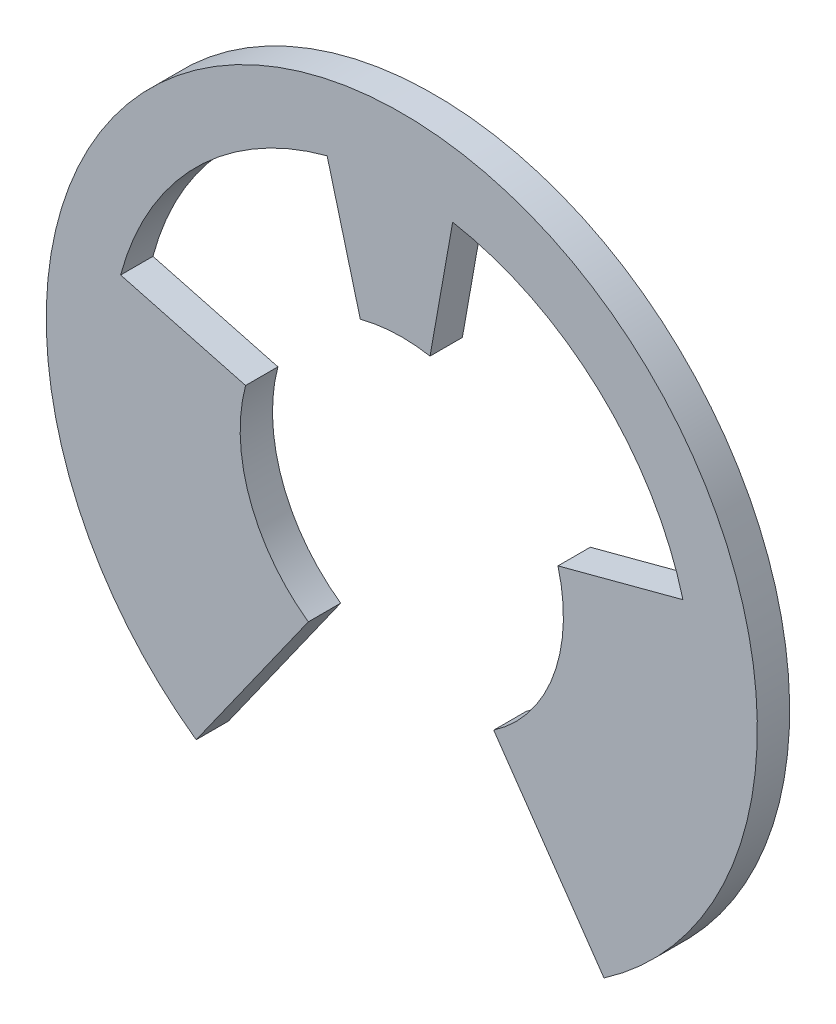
from build123d import *

# Parameters (mm, degrees)
BASE_EXTRUSION_DEPTH = 0.5


with BuildPart() as part:
    # Esquisse1 → Base-Extrusion (new body)
    with BuildSketch(Plane.XY):
        with BuildLine():
            Line((1.422006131, -2.05618544), (3.128413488, -4.523607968))
            ThreePointArc((3.128413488, -4.523607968), (0.031988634, 5.499906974), (-3.180820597, -4.486912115))
            Line((-3.180820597, -4.486912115), (-1.445827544, -2.039505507))
            ThreePointArc((-1.445827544, -2.039505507), (-2.350746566, -0.850876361), (-2.41627316, 0.641579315))
            Line((-2.41627316, 0.641579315), (-4.349291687, 1.154842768))
            ThreePointArc((-4.349291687, 1.154842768), (-3.181980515, 3.181980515), (-1.154842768, 4.349291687))
            Line((-1.154842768, 4.349291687), (-0.641579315, 2.41627316))
            ThreePointArc((-0.641579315, 2.41627316), (-0.104699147, 2.497806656), (0.437120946, 2.461488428))
            Line((0.437120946, 2.461488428), (0.786817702, 4.43067917))
            ThreePointArc((0.786817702, 4.43067917), (3.045928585, 3.312449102), (4.349291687, 1.154842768))
            Line((4.349291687, 1.154842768), (2.41627316, 0.641579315))
            ThreePointArc((2.41627316, 0.641579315), (2.345758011, -0.864534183), (1.422006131, -2.05618544))
        make_face()
    extrude(amount=BASE_EXTRUSION_DEPTH)


solid = part.part
